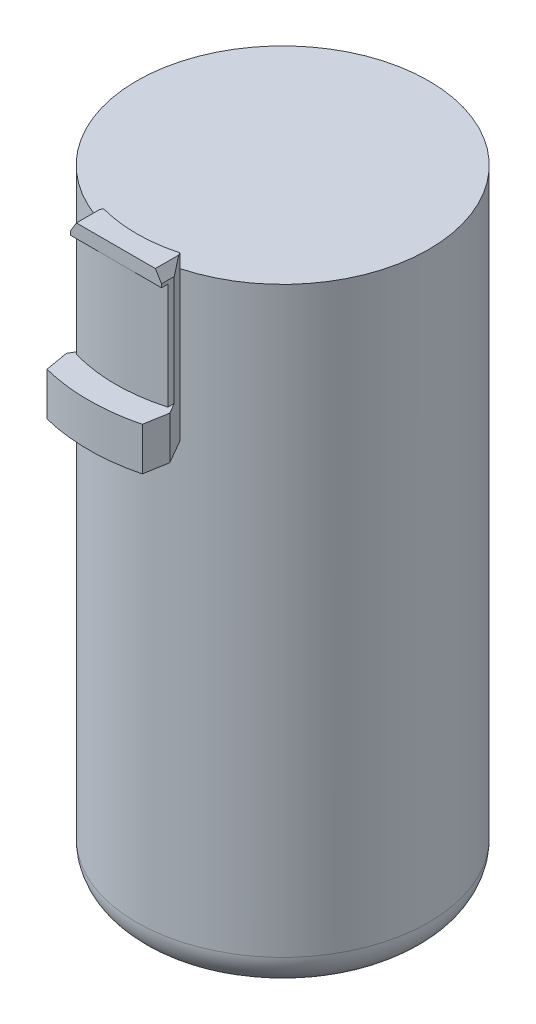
ISO-10303-21;
HEADER;
FILE_DESCRIPTION(('STEP AP214'),'2;1');
FILE_NAME('part.step','',(''),(''),'','','');
FILE_SCHEMA(('AUTOMOTIVE_DESIGN { 1 0 10303 214 1 1 1 1 }'));
ENDSEC;
DATA;
#1=APPLICATION_CONTEXT('core data for automotive mechanical design processes');
#2=APPLICATION_PROTOCOL_DEFINITION('international standard','automotive_design',2000,#1);
#3=PRODUCT_CONTEXT('',#1,'mechanical');
#4=PRODUCT('Part','Part','',(#3));
#5=PRODUCT_RELATED_PRODUCT_CATEGORY('part','',(#4));
#6=PRODUCT_DEFINITION_FORMATION('','',#4);
#7=PRODUCT_DEFINITION_CONTEXT('part definition',#1,'design');
#8=PRODUCT_DEFINITION('design','',#6,#7);
#9=PRODUCT_DEFINITION_SHAPE('','',#8);
#10=(LENGTH_UNIT() NAMED_UNIT(*) SI_UNIT(.MILLI.,.METRE.));
#11=(NAMED_UNIT(*) PLANE_ANGLE_UNIT() SI_UNIT($,.RADIAN.));
#12=(NAMED_UNIT(*) SI_UNIT($,.STERADIAN.) SOLID_ANGLE_UNIT());
#13=UNCERTAINTY_MEASURE_WITH_UNIT(LENGTH_MEASURE(1.E-05),#10,'distance_accuracy_value','');
#14=(GEOMETRIC_REPRESENTATION_CONTEXT(3) GLOBAL_UNCERTAINTY_ASSIGNED_CONTEXT((#13)) GLOBAL_UNIT_ASSIGNED_CONTEXT((#10,
#11,#12)) REPRESENTATION_CONTEXT('',''));
#15=CARTESIAN_POINT('',(0.,0.,0.));
#16=DIRECTION('',(0.,0.,1.));
#17=DIRECTION('',(1.,0.,0.));
#18=AXIS2_PLACEMENT_3D('',#15,#16,#17);
#19=CARTESIAN_POINT('',(0.,-124.,0.));
#20=DIRECTION('',(0.,1.,0.));
#21=DIRECTION('',(0.,0.,1.));
#22=AXIS2_PLACEMENT_3D('',#19,#20,#21);
#23=CYLINDRICAL_SURFACE('',#22,21.45);
#24=CARTESIAN_POINT('',(0.,-117.4,0.));
#25=DIRECTION('',(0.,1.,0.));
#26=DIRECTION('',(0.,0.,1.));
#27=AXIS2_PLACEMENT_3D('',#24,#25,#26);
#28=CIRCLE('',#27,21.45);
#29=CARTESIAN_POINT('',(0.,-117.4,21.45));
#30=VERTEX_POINT('',#29);
#31=EDGE_CURVE('E243',#30,#30,#28,.T.);
#32=ORIENTED_EDGE('',*,*,#31,.T.);
#33=EDGE_LOOP('',(#32));
#34=FACE_BOUND('',#33,.T.);
#35=DIRECTION('',(0.,1.,0.));
#36=VECTOR('',#35,1.);
#37=CARTESIAN_POINT('',(5.59120514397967,-124.,20.7084747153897));
#38=LINE('',#37,#36);
#39=CARTESIAN_POINT('',(5.59120514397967,-31.8,20.7084747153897));
#40=VERTEX_POINT('',#39);
#41=CARTESIAN_POINT('',(5.59120514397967,-53.76,20.7084747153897));
#42=VERTEX_POINT('',#41);
#43=EDGE_CURVE('E282',#40,#42,#38,.F.);
#44=ORIENTED_EDGE('',*,*,#43,.T.);
#45=CARTESIAN_POINT('',(0.,-53.76,0.));
#46=DIRECTION('',(0.,-1.,0.));
#47=DIRECTION('',(0.,0.,-1.));
#48=AXIS2_PLACEMENT_3D('',#45,#46,#47);
#49=CIRCLE('',#48,21.45);
#50=CARTESIAN_POINT('',(-5.59120514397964,-53.76,20.7084747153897));
#51=VERTEX_POINT('',#50);
#52=EDGE_CURVE('E11',#42,#51,#49,.T.);
#53=ORIENTED_EDGE('',*,*,#52,.T.);
#54=DIRECTION('',(0.,1.,0.));
#55=VECTOR('',#54,1.);
#56=CARTESIAN_POINT('',(-5.59120514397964,-124.,20.7084747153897));
#57=LINE('',#56,#55);
#58=CARTESIAN_POINT('',(-5.59120514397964,-31.8,20.7084747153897));
#59=VERTEX_POINT('',#58);
#60=EDGE_CURVE('E303',#51,#59,#57,.T.);
#61=ORIENTED_EDGE('',*,*,#60,.T.);
#62=CARTESIAN_POINT('',(0.,-31.8,0.));
#63=DIRECTION('',(0.,1.,0.));
#64=DIRECTION('',(0.,0.,1.));
#65=AXIS2_PLACEMENT_3D('',#62,#63,#64);
#66=CIRCLE('',#65,21.45);
#67=EDGE_CURVE('E304',#40,#59,#66,.T.);
#68=ORIENTED_EDGE('',*,*,#67,.F.);
#69=EDGE_LOOP('',(#44,#53,#61,#68));
#70=FACE_BOUND('',#69,.T.);
#71=ADVANCED_FACE('F17',(#34,#70),#23,.T.);
#72=CARTESIAN_POINT('',(-6.7,-29.8,24.5));
#73=DIRECTION('',(0.,0.,-1.));
#74=DIRECTION('',(-1.,0.,0.));
#75=AXIS2_PLACEMENT_3D('',#72,#73,#74);
#76=PLANE('',#75);
#77=DIRECTION('',(0.515038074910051,-0.857167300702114,0.));
#78=VECTOR('',#77,1.);
#79=CARTESIAN_POINT('',(2.48419726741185,-24.2815775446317,24.5));
#80=LINE('',#79,#78);
#81=CARTESIAN_POINT('',(5.8,-29.8,24.5));
#82=VERTEX_POINT('',#81);
#83=CARTESIAN_POINT('',(6.7,-31.2978515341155,24.5));
#84=VERTEX_POINT('',#83);
#85=EDGE_CURVE('E32',#82,#84,#80,.T.);
#86=ORIENTED_EDGE('',*,*,#85,.F.);
#87=DIRECTION('',(1.,0.,0.));
#88=VECTOR('',#87,1.);
#89=CARTESIAN_POINT('',(-6.7,-29.8,24.5));
#90=LINE('',#89,#88);
#91=CARTESIAN_POINT('',(-5.8,-29.8,24.5));
#92=VERTEX_POINT('',#91);
#93=EDGE_CURVE('E197',#92,#82,#90,.T.);
#94=ORIENTED_EDGE('',*,*,#93,.F.);
#95=DIRECTION('',(0.515038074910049,0.857167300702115,0.));
#96=VECTOR('',#95,1.);
#97=CARTESIAN_POINT('',(-6.03873779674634,-30.1973264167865,24.5));
#98=LINE('',#97,#96);
#99=CARTESIAN_POINT('',(-6.7,-31.2978515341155,24.5));
#100=VERTEX_POINT('',#99);
#101=EDGE_CURVE('E40',#100,#92,#98,.T.);
#102=ORIENTED_EDGE('',*,*,#101,.F.);
#103=DIRECTION('',(0.,-1.,0.));
#104=VECTOR('',#103,1.);
#105=CARTESIAN_POINT('',(-6.7,-29.8,24.5));
#106=LINE('',#105,#104);
#107=CARTESIAN_POINT('',(-6.7,-31.8,24.5));
#108=VERTEX_POINT('',#107);
#109=EDGE_CURVE('E258',#100,#108,#106,.T.);
#110=ORIENTED_EDGE('',*,*,#109,.T.);
#111=DIRECTION('',(1.,0.,0.));
#112=VECTOR('',#111,1.);
#113=CARTESIAN_POINT('',(-6.7,-31.8,24.5));
#114=LINE('',#113,#112);
#115=CARTESIAN_POINT('',(0.,-31.8,24.5));
#116=VERTEX_POINT('',#115);
#117=EDGE_CURVE('E208',#108,#116,#114,.T.);
#118=ORIENTED_EDGE('',*,*,#117,.T.);
#119=CARTESIAN_POINT('',(6.7,-31.8,24.5));
#120=VERTEX_POINT('',#119);
#121=EDGE_CURVE('E214',#116,#120,#114,.T.);
#122=ORIENTED_EDGE('',*,*,#121,.T.);
#123=DIRECTION('',(0.,-1.,0.));
#124=VECTOR('',#123,1.);
#125=CARTESIAN_POINT('',(6.7,-29.8,24.5));
#126=LINE('',#125,#124);
#127=EDGE_CURVE('E249',#84,#120,#126,.T.);
#128=ORIENTED_EDGE('',*,*,#127,.F.);
#129=EDGE_LOOP('',(#86,#94,#102,#110,#118,#122,#128));
#130=FACE_BOUND('',#129,.T.);
#131=ADVANCED_FACE('F253',(#130),#76,.F.);
#132=CARTESIAN_POINT('',(0.,-29.8,0.));
#133=DIRECTION('',(0.,1.,0.));
#134=DIRECTION('',(0.,0.,1.));
#135=AXIS2_PLACEMENT_3D('',#132,#133,#134);
#136=PLANE('',#135);
#137=ORIENTED_EDGE('',*,*,#93,.T.);
#138=DIRECTION('',(0.,0.,-1.));
#139=VECTOR('',#138,1.);
#140=CARTESIAN_POINT('',(5.8,-29.8,24.500025));
#141=LINE('',#140,#139);
#142=CARTESIAN_POINT('',(5.8,-29.8,21.070118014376));
#143=VERTEX_POINT('',#142);
#144=EDGE_CURVE('E146',#82,#143,#141,.T.);
#145=ORIENTED_EDGE('',*,*,#144,.T.);
#146=DIRECTION('',(-0.499999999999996,0.,-0.866025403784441));
#147=VECTOR('',#146,1.);
#148=CARTESIAN_POINT('',(6.7,-29.8,22.628963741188));
#149=LINE('',#148,#147);
#150=CARTESIAN_POINT('',(5.59120514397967,-29.8,20.7084747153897));
#151=VERTEX_POINT('',#150);
#152=EDGE_CURVE('E200',#143,#151,#149,.T.);
#153=ORIENTED_EDGE('',*,*,#152,.T.);
#154=CARTESIAN_POINT('',(0.,-29.8,0.));
#155=DIRECTION('',(0.,-1.,0.));
#156=DIRECTION('',(0.,0.,1.));
#157=AXIS2_PLACEMENT_3D('',#154,#155,#156);
#158=CIRCLE('',#157,21.45);
#159=CARTESIAN_POINT('',(-5.59120514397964,-29.8,20.7084747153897));
#160=VERTEX_POINT('',#159);
#161=EDGE_CURVE('E190',#151,#160,#158,.T.);
#162=ORIENTED_EDGE('',*,*,#161,.T.);
#163=DIRECTION('',(-0.500000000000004,0.,0.866025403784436));
#164=VECTOR('',#163,1.);
#165=CARTESIAN_POINT('',(-5.59120514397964,-29.8,20.7084747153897));
#166=LINE('',#165,#164);
#167=CARTESIAN_POINT('',(-5.8,-29.8,21.070118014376));
#168=VERTEX_POINT('',#167);
#169=EDGE_CURVE('E193',#160,#168,#166,.T.);
#170=ORIENTED_EDGE('',*,*,#169,.T.);
#171=DIRECTION('',(0.,0.,1.));
#172=VECTOR('',#171,1.);
#173=CARTESIAN_POINT('',(-5.8,-29.8,0.));
#174=LINE('',#173,#172);
#175=EDGE_CURVE('E242',#168,#92,#174,.T.);
#176=ORIENTED_EDGE('',*,*,#175,.T.);
#177=EDGE_LOOP('',(#137,#145,#153,#162,#170,#176));
#178=FACE_BOUND('',#177,.T.);
#179=ADVANCED_FACE('F354',(#178),#136,.T.);
#180=CARTESIAN_POINT('',(6.7,-47.45,22.628963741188));
#181=DIRECTION('',(0.866025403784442,0.,-0.499999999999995));
#182=DIRECTION('',(-0.499999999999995,0.,-0.866025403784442));
#183=AXIS2_PLACEMENT_3D('',#180,#181,#182);
#184=PLANE('',#183);
#185=ORIENTED_EDGE('',*,*,#152,.F.);
#186=DIRECTION('',(0.384336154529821,-0.639642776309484,0.665689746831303));
#187=VECTOR('',#186,1.);
#188=CARTESIAN_POINT('',(10.6708093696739,-37.906388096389,29.5066073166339));
#189=LINE('',#188,#187);
#190=CARTESIAN_POINT('',(6.7,-31.2978515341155,22.628963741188));
#191=VERTEX_POINT('',#190);
#192=EDGE_CURVE('E178',#143,#191,#189,.T.);
#193=ORIENTED_EDGE('',*,*,#192,.T.);
#194=DIRECTION('',(0.,1.,0.));
#195=VECTOR('',#194,1.);
#196=CARTESIAN_POINT('',(6.7,-47.45,22.628963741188));
#197=LINE('',#196,#195);
#198=CARTESIAN_POINT('',(6.7,-47.45,22.628963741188));
#199=VERTEX_POINT('',#198);
#200=EDGE_CURVE('E251',#199,#191,#197,.T.);
#201=ORIENTED_EDGE('',*,*,#200,.F.);
#202=DIRECTION('',(0.499999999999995,0.,0.866025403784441));
#203=VECTOR('',#202,1.);
#204=CARTESIAN_POINT('',(7.59810442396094,-47.45,24.1845262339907));
#205=LINE('',#204,#203);
#206=CARTESIAN_POINT('',(7.59810442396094,-47.45,24.1845262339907));
#207=VERTEX_POINT('',#206);
#208=EDGE_CURVE('E143',#199,#207,#205,.T.);
#209=ORIENTED_EDGE('',*,*,#208,.T.);
#210=DIRECTION('',(0.,1.,0.));
#211=VECTOR('',#210,1.);
#212=CARTESIAN_POINT('',(7.59810442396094,-53.76,24.1845262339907));
#213=LINE('',#212,#211);
#214=CARTESIAN_POINT('',(7.59810442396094,-53.76,24.1845262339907));
#215=VERTEX_POINT('',#214);
#216=EDGE_CURVE('E139',#215,#207,#213,.T.);
#217=ORIENTED_EDGE('',*,*,#216,.F.);
#218=DIRECTION('',(0.499999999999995,0.,0.866025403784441));
#219=VECTOR('',#218,1.);
#220=CARTESIAN_POINT('',(7.59810442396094,-53.76,24.1845262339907));
#221=LINE('',#220,#219);
#222=EDGE_CURVE('E127',#42,#215,#221,.T.);
#223=ORIENTED_EDGE('',*,*,#222,.F.);
#224=ORIENTED_EDGE('',*,*,#43,.F.);
#225=DIRECTION('',(0.,-1.,0.));
#226=VECTOR('',#225,1.);
#227=CARTESIAN_POINT('',(5.59120514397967,-29.8,20.7084747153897));
#228=LINE('',#227,#226);
#229=EDGE_CURVE('E202',#151,#40,#228,.T.);
#230=ORIENTED_EDGE('',*,*,#229,.F.);
#231=EDGE_LOOP('',(#185,#193,#201,#209,#217,#223,#224,#230));
#232=FACE_BOUND('',#231,.T.);
#233=ADVANCED_FACE('F141',(#232),#184,.T.);
#234=CARTESIAN_POINT('',(6.7,-47.45,22.628963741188));
#235=DIRECTION('',(1.,0.,0.));
#236=DIRECTION('',(0.,0.,-1.));
#237=AXIS2_PLACEMENT_3D('',#234,#235,#236);
#238=PLANE('',#237);
#239=ORIENTED_EDGE('',*,*,#200,.T.);
#240=DIRECTION('',(0.,0.,1.));
#241=VECTOR('',#240,1.);
#242=CARTESIAN_POINT('',(6.7,-31.2978515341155,22.628963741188));
#243=LINE('',#242,#241);
#244=EDGE_CURVE('E25',#191,#84,#243,.T.);
#245=ORIENTED_EDGE('',*,*,#244,.T.);
#246=ORIENTED_EDGE('',*,*,#127,.T.);
#247=DIRECTION('',(0.,0.,-1.));
#248=VECTOR('',#247,1.);
#249=CARTESIAN_POINT('',(6.7,-31.8,24.5));
#250=LINE('',#249,#248);
#251=CARTESIAN_POINT('',(6.7,-31.8,23.5660773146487));
#252=VERTEX_POINT('',#251);
#253=EDGE_CURVE('E194',#120,#252,#250,.T.);
#254=ORIENTED_EDGE('',*,*,#253,.T.);
#255=DIRECTION('',(0.,1.,0.));
#256=VECTOR('',#255,1.);
#257=CARTESIAN_POINT('',(6.7,-47.45,23.5660773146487));
#258=LINE('',#257,#256);
#259=CARTESIAN_POINT('',(6.7,-47.45,23.5660773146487));
#260=VERTEX_POINT('',#259);
#261=EDGE_CURVE('E226',#260,#252,#258,.T.);
#262=ORIENTED_EDGE('',*,*,#261,.F.);
#263=DIRECTION('',(0.,0.,-1.));
#264=VECTOR('',#263,1.);
#265=CARTESIAN_POINT('',(6.7,-47.45,22.628963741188));
#266=LINE('',#265,#264);
#267=EDGE_CURVE('E219',#260,#199,#266,.T.);
#268=ORIENTED_EDGE('',*,*,#267,.T.);
#269=EDGE_LOOP('',(#239,#245,#246,#254,#262,#268));
#270=FACE_BOUND('',#269,.T.);
#271=ADVANCED_FACE('F247',(#270),#238,.T.);
#272=CARTESIAN_POINT('',(-6.7,-47.45,22.628963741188));
#273=DIRECTION('',(-0.866025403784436,0.,-0.500000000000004));
#274=DIRECTION('',(-0.500000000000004,0.,0.866025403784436));
#275=AXIS2_PLACEMENT_3D('',#272,#273,#274);
#276=PLANE('',#275);
#277=DIRECTION('',(0.,1.,0.));
#278=VECTOR('',#277,1.);
#279=CARTESIAN_POINT('',(-6.7,-47.45,22.628963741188));
#280=LINE('',#279,#278);
#281=CARTESIAN_POINT('',(-6.7,-47.45,22.628963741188));
#282=VERTEX_POINT('',#281);
#283=CARTESIAN_POINT('',(-6.7,-31.2978515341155,22.628963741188));
#284=VERTEX_POINT('',#283);
#285=EDGE_CURVE('E229',#282,#284,#280,.T.);
#286=ORIENTED_EDGE('',*,*,#285,.T.);
#287=DIRECTION('',(0.384336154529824,0.639642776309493,-0.665689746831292));
#288=VECTOR('',#287,1.);
#289=CARTESIAN_POINT('',(-10.670809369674,-37.9063880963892,29.5066073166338));
#290=LINE('',#289,#288);
#291=EDGE_CURVE('E186',#284,#168,#290,.T.);
#292=ORIENTED_EDGE('',*,*,#291,.T.);
#293=ORIENTED_EDGE('',*,*,#169,.F.);
#294=DIRECTION('',(0.,-1.,0.));
#295=VECTOR('',#294,1.);
#296=CARTESIAN_POINT('',(-5.59120514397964,-29.8,20.7084747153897));
#297=LINE('',#296,#295);
#298=EDGE_CURVE('E260',#160,#59,#297,.T.);
#299=ORIENTED_EDGE('',*,*,#298,.T.);
#300=ORIENTED_EDGE('',*,*,#60,.F.);
#301=DIRECTION('',(0.500000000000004,0.,-0.866025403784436));
#302=VECTOR('',#301,1.);
#303=CARTESIAN_POINT('',(-5.53945913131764,-53.76,20.61884799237));
#304=LINE('',#303,#302);
#305=CARTESIAN_POINT('',(-7.59810442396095,-53.76,24.1845262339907));
#306=VERTEX_POINT('',#305);
#307=EDGE_CURVE('E158',#306,#51,#304,.T.);
#308=ORIENTED_EDGE('',*,*,#307,.F.);
#309=DIRECTION('',(0.,1.,0.));
#310=VECTOR('',#309,1.);
#311=CARTESIAN_POINT('',(-7.59810442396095,-53.76,24.1845262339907));
#312=LINE('',#311,#310);
#313=CARTESIAN_POINT('',(-7.59810442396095,-47.45,24.1845262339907));
#314=VERTEX_POINT('',#313);
#315=EDGE_CURVE('E160',#306,#314,#312,.T.);
#316=ORIENTED_EDGE('',*,*,#315,.T.);
#317=DIRECTION('',(0.500000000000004,0.,-0.866025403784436));
#318=VECTOR('',#317,1.);
#319=CARTESIAN_POINT('',(-5.53945913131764,-47.45,20.61884799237));
#320=LINE('',#319,#318);
#321=EDGE_CURVE('E136',#314,#282,#320,.T.);
#322=ORIENTED_EDGE('',*,*,#321,.T.);
#323=EDGE_LOOP('',(#286,#292,#293,#299,#300,#308,#316,#322));
#324=FACE_BOUND('',#323,.T.);
#325=ADVANCED_FACE('F290',(#324),#276,.T.);
#326=CARTESIAN_POINT('',(-6.7,-47.45,22.628963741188));
#327=DIRECTION('',(-1.,0.,0.));
#328=DIRECTION('',(0.,0.,1.));
#329=AXIS2_PLACEMENT_3D('',#326,#327,#328);
#330=PLANE('',#329);
#331=ORIENTED_EDGE('',*,*,#109,.F.);
#332=DIRECTION('',(0.,0.,-1.));
#333=VECTOR('',#332,1.);
#334=CARTESIAN_POINT('',(-6.7,-31.2978515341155,24.500025));
#335=LINE('',#334,#333);
#336=EDGE_CURVE('E182',#100,#284,#335,.T.);
#337=ORIENTED_EDGE('',*,*,#336,.T.);
#338=ORIENTED_EDGE('',*,*,#285,.F.);
#339=DIRECTION('',(0.,0.,1.));
#340=VECTOR('',#339,1.);
#341=CARTESIAN_POINT('',(-6.7,-47.45,22.628963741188));
#342=LINE('',#341,#340);
#343=CARTESIAN_POINT('',(-6.7,-47.45,23.5660773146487));
#344=VERTEX_POINT('',#343);
#345=EDGE_CURVE('E223',#282,#344,#342,.T.);
#346=ORIENTED_EDGE('',*,*,#345,.T.);
#347=DIRECTION('',(0.,1.,0.));
#348=VECTOR('',#347,1.);
#349=CARTESIAN_POINT('',(-6.7,-47.45,23.5660773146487));
#350=LINE('',#349,#348);
#351=CARTESIAN_POINT('',(-6.7,-31.8,23.5660773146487));
#352=VERTEX_POINT('',#351);
#353=EDGE_CURVE('E280',#344,#352,#350,.T.);
#354=ORIENTED_EDGE('',*,*,#353,.T.);
#355=DIRECTION('',(0.,0.,1.));
#356=VECTOR('',#355,1.);
#357=CARTESIAN_POINT('',(-6.7,-31.8,22.628963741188));
#358=LINE('',#357,#356);
#359=EDGE_CURVE('E205',#352,#108,#358,.T.);
#360=ORIENTED_EDGE('',*,*,#359,.T.);
#361=EDGE_LOOP('',(#331,#337,#338,#346,#354,#360));
#362=FACE_BOUND('',#361,.T.);
#363=ADVANCED_FACE('F284',(#362),#330,.T.);
#364=CARTESIAN_POINT('',(0.,-31.8,0.));
#365=DIRECTION('',(0.,-1.,0.));
#366=DIRECTION('',(0.,0.,-1.));
#367=AXIS2_PLACEMENT_3D('',#364,#365,#366);
#368=PLANE('',#367);
#369=CARTESIAN_POINT('',(0.,-31.8,0.));
#370=DIRECTION('',(0.,-1.,0.));
#371=DIRECTION('',(0.,0.,1.));
#372=AXIS2_PLACEMENT_3D('',#369,#370,#371);
#373=CIRCLE('',#372,21.45);
#374=EDGE_CURVE('E189',#40,#59,#373,.T.);
#375=ORIENTED_EDGE('',*,*,#374,.F.);
#376=ORIENTED_EDGE('',*,*,#67,.T.);
#377=EDGE_LOOP('',(#375,#376));
#378=FACE_BOUND('',#377,.T.);
#379=ADVANCED_FACE('F19',(#378),#368,.F.);
#380=CARTESIAN_POINT('',(0.,-117.4,0.));
#381=DIRECTION('',(0.,1.,0.));
#382=DIRECTION('',(0.,0.,1.));
#383=AXIS2_PLACEMENT_3D('',#380,#381,#382);
#384=TOROIDAL_SURFACE('',#383,16.35,5.09999999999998);
#385=ORIENTED_EDGE('',*,*,#31,.F.);
#386=EDGE_LOOP('',(#385));
#387=FACE_BOUND('',#386,.T.);
#388=CARTESIAN_POINT('',(0.,-122.5,0.));
#389=DIRECTION('',(0.,1.,0.));
#390=DIRECTION('',(0.,0.,1.));
#391=AXIS2_PLACEMENT_3D('',#388,#389,#390);
#392=CIRCLE('',#391,16.35);
#393=CARTESIAN_POINT('',(0.,-122.5,16.35));
#394=VERTEX_POINT('',#393);
#395=EDGE_CURVE('E316',#394,#394,#392,.T.);
#396=ORIENTED_EDGE('',*,*,#395,.T.);
#397=EDGE_LOOP('',(#396));
#398=FACE_BOUND('',#397,.T.);
#399=ADVANCED_FACE('F322',(#387,#398),#384,.T.);
#400=CARTESIAN_POINT('',(13.65,-122.5,0.));
#401=DIRECTION('',(0.,1.,0.));
#402=DIRECTION('',(0.,0.,1.));
#403=AXIS2_PLACEMENT_3D('',#400,#401,#402);
#404=PLANE('',#403);
#405=ORIENTED_EDGE('',*,*,#395,.F.);
#406=EDGE_LOOP('',(#405));
#407=FACE_BOUND('',#406,.T.);
#408=CARTESIAN_POINT('',(0.,-122.5,0.));
#409=DIRECTION('',(0.,1.,0.));
#410=DIRECTION('',(0.,0.,1.));
#411=AXIS2_PLACEMENT_3D('',#408,#409,#410);
#412=CIRCLE('',#411,13.65);
#413=CARTESIAN_POINT('',(0.,-122.5,13.65));
#414=VERTEX_POINT('',#413);
#415=EDGE_CURVE('E313',#414,#414,#412,.T.);
#416=ORIENTED_EDGE('',*,*,#415,.T.);
#417=EDGE_LOOP('',(#416));
#418=FACE_BOUND('',#417,.T.);
#419=ADVANCED_FACE('F325',(#407,#418),#404,.F.);
#420=CARTESIAN_POINT('',(0.,-124.,0.));
#421=DIRECTION('',(0.,1.,0.));
#422=DIRECTION('',(0.,0.,1.));
#423=AXIS2_PLACEMENT_3D('',#420,#421,#422);
#424=CYLINDRICAL_SURFACE('',#423,13.65);
#425=ORIENTED_EDGE('',*,*,#415,.F.);
#426=EDGE_LOOP('',(#425));
#427=FACE_BOUND('',#426,.T.);
#428=CARTESIAN_POINT('',(0.,-124.,0.));
#429=DIRECTION('',(0.,1.,0.));
#430=DIRECTION('',(0.,0.,1.));
#431=AXIS2_PLACEMENT_3D('',#428,#429,#430);
#432=CIRCLE('',#431,13.65);
#433=CARTESIAN_POINT('',(0.,-124.,13.65));
#434=VERTEX_POINT('',#433);
#435=EDGE_CURVE('E310',#434,#434,#432,.T.);
#436=ORIENTED_EDGE('',*,*,#435,.T.);
#437=EDGE_LOOP('',(#436));
#438=FACE_BOUND('',#437,.T.);
#439=ADVANCED_FACE('F331',(#427,#438),#424,.T.);
#440=CARTESIAN_POINT('',(13.65,-124.,0.));
#441=DIRECTION('',(0.,1.,0.));
#442=DIRECTION('',(0.,0.,1.));
#443=AXIS2_PLACEMENT_3D('',#440,#441,#442);
#444=PLANE('',#443);
#445=ORIENTED_EDGE('',*,*,#435,.F.);
#446=EDGE_LOOP('',(#445));
#447=FACE_BOUND('',#446,.T.);
#448=ADVANCED_FACE('F337',(#447),#444,.F.);
#449=CARTESIAN_POINT('',(0.,-47.45,0.));
#450=DIRECTION('',(0.,1.,0.));
#451=DIRECTION('',(0.,0.,1.));
#452=AXIS2_PLACEMENT_3D('',#449,#450,#451);
#453=CYLINDRICAL_SURFACE('',#452,24.5);
#454=CARTESIAN_POINT('',(0.,-31.8,0.));
#455=DIRECTION('',(0.,1.,0.));
#456=DIRECTION('',(0.,0.,1.));
#457=AXIS2_PLACEMENT_3D('',#454,#455,#456);
#458=CIRCLE('',#457,24.5);
#459=EDGE_CURVE('E220',#352,#116,#458,.T.);
#460=ORIENTED_EDGE('',*,*,#459,.F.);
#461=ORIENTED_EDGE('',*,*,#353,.F.);
#462=CARTESIAN_POINT('',(0.,-47.45,0.));
#463=DIRECTION('',(0.,1.,0.));
#464=DIRECTION('',(0.,0.,1.));
#465=AXIS2_PLACEMENT_3D('',#462,#463,#464);
#466=CIRCLE('',#465,24.5);
#467=EDGE_CURVE('E216',#344,#260,#466,.T.);
#468=ORIENTED_EDGE('',*,*,#467,.T.);
#469=ORIENTED_EDGE('',*,*,#261,.T.);
#470=EDGE_CURVE('E233',#116,#252,#458,.T.);
#471=ORIENTED_EDGE('',*,*,#470,.F.);
#472=EDGE_LOOP('',(#460,#461,#468,#469,#471));
#473=FACE_BOUND('',#472,.T.);
#474=ADVANCED_FACE('F279',(#473),#453,.T.);
#475=CARTESIAN_POINT('',(0.,-31.8,0.));
#476=DIRECTION('',(0.,1.,0.));
#477=DIRECTION('',(0.,0.,1.));
#478=AXIS2_PLACEMENT_3D('',#475,#476,#477);
#479=PLANE('',#478);
#480=ORIENTED_EDGE('',*,*,#359,.F.);
#481=ORIENTED_EDGE('',*,*,#459,.T.);
#482=ORIENTED_EDGE('',*,*,#117,.F.);
#483=EDGE_LOOP('',(#480,#481,#482));
#484=FACE_BOUND('',#483,.T.);
#485=ADVANCED_FACE('F277',(#484),#479,.F.);
#486=ORIENTED_EDGE('',*,*,#121,.F.);
#487=ORIENTED_EDGE('',*,*,#470,.T.);
#488=ORIENTED_EDGE('',*,*,#253,.F.);
#489=EDGE_LOOP('',(#486,#487,#488));
#490=FACE_BOUND('',#489,.T.);
#491=ADVANCED_FACE('F269',(#490),#479,.F.);
#492=CARTESIAN_POINT('',(0.,-29.8,0.));
#493=DIRECTION('',(0.,-1.,0.));
#494=DIRECTION('',(0.,0.,-1.));
#495=AXIS2_PLACEMENT_3D('',#492,#493,#494);
#496=CYLINDRICAL_SURFACE('',#495,21.45);
#497=ORIENTED_EDGE('',*,*,#374,.T.);
#498=ORIENTED_EDGE('',*,*,#298,.F.);
#499=ORIENTED_EDGE('',*,*,#161,.F.);
#500=ORIENTED_EDGE('',*,*,#229,.T.);
#501=EDGE_LOOP('',(#497,#498,#499,#500));
#502=FACE_BOUND('',#501,.T.);
#503=ADVANCED_FACE('F364',(#502),#496,.F.);
#504=CARTESIAN_POINT('',(-5.8,-29.8,24.500025));
#505=DIRECTION('',(-0.857167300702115,0.515038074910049,0.));
#506=DIRECTION('',(-0.515038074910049,-0.857167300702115,0.));
#507=AXIS2_PLACEMENT_3D('',#504,#505,#506);
#508=PLANE('',#507);
#509=ORIENTED_EDGE('',*,*,#336,.F.);
#510=ORIENTED_EDGE('',*,*,#101,.T.);
#511=ORIENTED_EDGE('',*,*,#175,.F.);
#512=ORIENTED_EDGE('',*,*,#291,.F.);
#513=EDGE_LOOP('',(#509,#510,#511,#512));
#514=FACE_BOUND('',#513,.T.);
#515=ADVANCED_FACE('F367',(#514),#508,.T.);
#516=CARTESIAN_POINT('',(6.7,-31.2978515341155,24.500025));
#517=DIRECTION('',(0.857167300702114,0.515038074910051,0.));
#518=DIRECTION('',(-0.515038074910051,0.857167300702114,0.));
#519=AXIS2_PLACEMENT_3D('',#516,#517,#518);
#520=PLANE('',#519);
#521=ORIENTED_EDGE('',*,*,#85,.T.);
#522=ORIENTED_EDGE('',*,*,#244,.F.);
#523=ORIENTED_EDGE('',*,*,#192,.F.);
#524=ORIENTED_EDGE('',*,*,#144,.F.);
#525=EDGE_LOOP('',(#521,#522,#523,#524));
#526=FACE_BOUND('',#525,.T.);
#527=ADVANCED_FACE('F458',(#526),#520,.T.);
#528=CARTESIAN_POINT('',(0.,-53.76,0.));
#529=DIRECTION('',(0.,-1.,0.));
#530=DIRECTION('',(0.,0.,-1.));
#531=AXIS2_PLACEMENT_3D('',#528,#529,#530);
#532=PLANE('',#531);
#533=ORIENTED_EDGE('',*,*,#52,.F.);
#534=ORIENTED_EDGE('',*,*,#222,.T.);
#535=DIRECTION('',(-0.171179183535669,0.,0.985239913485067));
#536=VECTOR('',#535,1.);
#537=CARTESIAN_POINT('',(7.,-53.76,27.6269795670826));
#538=LINE('',#537,#536);
#539=CARTESIAN_POINT('',(6.99999999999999,-53.76,27.6269795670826));
#540=VERTEX_POINT('',#539);
#541=EDGE_CURVE('E131',#215,#540,#538,.T.);
#542=ORIENTED_EDGE('',*,*,#541,.T.);
#543=CARTESIAN_POINT('',(0.,-53.76,0.));
#544=DIRECTION('',(0.,-1.,0.));
#545=DIRECTION('',(0.,0.,-1.));
#546=AXIS2_PLACEMENT_3D('',#543,#544,#545);
#547=CIRCLE('',#546,28.5);
#548=CARTESIAN_POINT('',(-7.,-53.76,27.6269795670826));
#549=VERTEX_POINT('',#548);
#550=EDGE_CURVE('E152',#540,#549,#547,.T.);
#551=ORIENTED_EDGE('',*,*,#550,.T.);
#552=DIRECTION('',(-0.171179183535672,0.,-0.985239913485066));
#553=VECTOR('',#552,1.);
#554=CARTESIAN_POINT('',(-7.,-53.76,27.6269795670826));
#555=LINE('',#554,#553);
#556=EDGE_CURVE('E154',#549,#306,#555,.T.);
#557=ORIENTED_EDGE('',*,*,#556,.T.);
#558=ORIENTED_EDGE('',*,*,#307,.T.);
#559=EDGE_LOOP('',(#533,#534,#542,#551,#557,#558));
#560=FACE_BOUND('',#559,.T.);
#561=ADVANCED_FACE('F129',(#560),#532,.T.);
#562=CARTESIAN_POINT('',(7.,-53.76,27.6269795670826));
#563=DIRECTION('',(-0.985239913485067,0.,-0.171179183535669));
#564=DIRECTION('',(-0.171179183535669,0.,0.985239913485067));
#565=AXIS2_PLACEMENT_3D('',#562,#563,#564);
#566=PLANE('',#565);
#567=DIRECTION('',(-0.171179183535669,0.,0.985239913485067));
#568=VECTOR('',#567,1.);
#569=CARTESIAN_POINT('',(7.,-47.45,27.6269795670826));
#570=LINE('',#569,#568);
#571=CARTESIAN_POINT('',(6.99999999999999,-47.45,27.6269795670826));
#572=VERTEX_POINT('',#571);
#573=EDGE_CURVE('E162',#207,#572,#570,.T.);
#574=ORIENTED_EDGE('',*,*,#573,.T.);
#575=DIRECTION('',(0.,1.,0.));
#576=VECTOR('',#575,1.);
#577=CARTESIAN_POINT('',(6.99999999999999,-53.76,27.6269795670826));
#578=LINE('',#577,#576);
#579=EDGE_CURVE('E147',#540,#572,#578,.T.);
#580=ORIENTED_EDGE('',*,*,#579,.F.);
#581=ORIENTED_EDGE('',*,*,#541,.F.);
#582=ORIENTED_EDGE('',*,*,#216,.T.);
#583=EDGE_LOOP('',(#574,#580,#581,#582));
#584=FACE_BOUND('',#583,.T.);
#585=ADVANCED_FACE('F149',(#584),#566,.F.);
#586=CARTESIAN_POINT('',(0.,-53.76,0.));
#587=DIRECTION('',(0.,1.,0.));
#588=DIRECTION('',(0.,0.,1.));
#589=AXIS2_PLACEMENT_3D('',#586,#587,#588);
#590=CYLINDRICAL_SURFACE('',#589,28.5);
#591=CARTESIAN_POINT('',(0.,-47.45,0.));
#592=DIRECTION('',(0.,-1.,0.));
#593=DIRECTION('',(0.,0.,-1.));
#594=AXIS2_PLACEMENT_3D('',#591,#592,#593);
#595=CIRCLE('',#594,28.5);
#596=CARTESIAN_POINT('',(-7.,-47.45,27.6269795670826));
#597=VERTEX_POINT('',#596);
#598=EDGE_CURVE('E164',#572,#597,#595,.T.);
#599=ORIENTED_EDGE('',*,*,#598,.T.);
#600=DIRECTION('',(0.,1.,0.));
#601=VECTOR('',#600,1.);
#602=CARTESIAN_POINT('',(-7.,-53.76,27.6269795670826));
#603=LINE('',#602,#601);
#604=EDGE_CURVE('E172',#549,#597,#603,.T.);
#605=ORIENTED_EDGE('',*,*,#604,.F.);
#606=ORIENTED_EDGE('',*,*,#550,.F.);
#607=ORIENTED_EDGE('',*,*,#579,.T.);
#608=EDGE_LOOP('',(#599,#605,#606,#607));
#609=FACE_BOUND('',#608,.T.);
#610=ADVANCED_FACE('F299',(#609),#590,.T.);
#611=CARTESIAN_POINT('',(-7.,-53.76,27.6269795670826));
#612=DIRECTION('',(0.985239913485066,0.,-0.171179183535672));
#613=DIRECTION('',(-0.171179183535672,0.,-0.985239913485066));
#614=AXIS2_PLACEMENT_3D('',#611,#612,#613);
#615=PLANE('',#614);
#616=DIRECTION('',(-0.171179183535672,0.,-0.985239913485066));
#617=VECTOR('',#616,1.);
#618=CARTESIAN_POINT('',(-7.,-47.45,27.6269795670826));
#619=LINE('',#618,#617);
#620=EDGE_CURVE('E166',#597,#314,#619,.T.);
#621=ORIENTED_EDGE('',*,*,#620,.T.);
#622=ORIENTED_EDGE('',*,*,#315,.F.);
#623=ORIENTED_EDGE('',*,*,#556,.F.);
#624=ORIENTED_EDGE('',*,*,#604,.T.);
#625=EDGE_LOOP('',(#621,#622,#623,#624));
#626=FACE_BOUND('',#625,.T.);
#627=ADVANCED_FACE('F295',(#626),#615,.F.);
#628=CARTESIAN_POINT('',(0.,-47.45,0.));
#629=DIRECTION('',(0.,-1.,0.));
#630=DIRECTION('',(0.,0.,-1.));
#631=AXIS2_PLACEMENT_3D('',#628,#629,#630);
#632=PLANE('',#631);
#633=ORIENTED_EDGE('',*,*,#267,.F.);
#634=ORIENTED_EDGE('',*,*,#467,.F.);
#635=ORIENTED_EDGE('',*,*,#345,.F.);
#636=ORIENTED_EDGE('',*,*,#321,.F.);
#637=ORIENTED_EDGE('',*,*,#620,.F.);
#638=ORIENTED_EDGE('',*,*,#598,.F.);
#639=ORIENTED_EDGE('',*,*,#573,.F.);
#640=ORIENTED_EDGE('',*,*,#208,.F.);
#641=EDGE_LOOP('',(#633,#634,#635,#636,#637,#638,#639,#640));
#642=FACE_BOUND('',#641,.T.);
#643=ADVANCED_FACE('F288',(#642),#632,.F.);
#644=CLOSED_SHELL('',(#71,#131,#179,#233,#271,#325,#363,#379,#399,#419,#439,#448,#474,#485,#491,
#503,#515,#527,#561,#585,#610,#627,#643));
#645=MANIFOLD_SOLID_BREP('B1',#644);
#646=ADVANCED_BREP_SHAPE_REPRESENTATION('',(#18,#645),#14);
#647=SHAPE_DEFINITION_REPRESENTATION(#9,#646);
ENDSEC;
END-ISO-10303-21;
